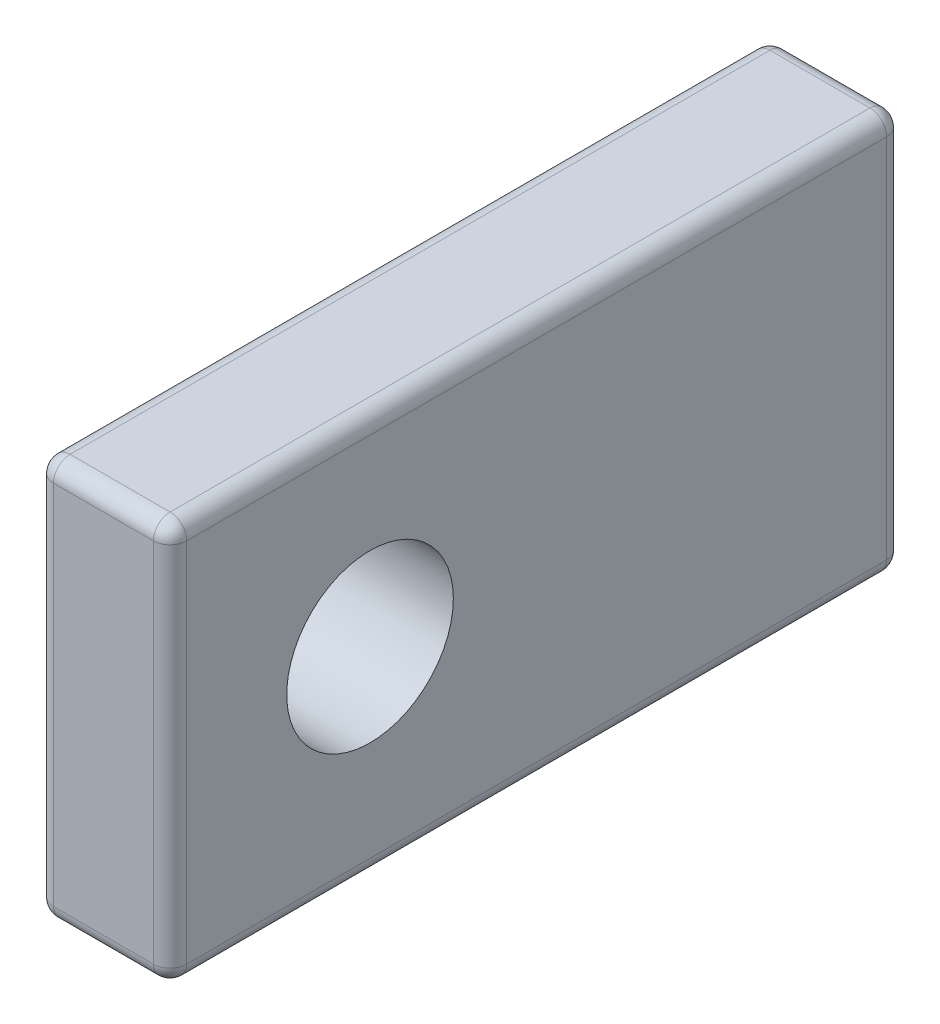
from build123d import *

# Parameters (mm, degrees)
SKETCH2_W           = 34.925
SKETCH2_H           = 19.05
SKETCH2_R           = 3.96875
BOSS_EXTRUDE1_DEPTH = 3.175
FILLET1_R           = 0.79375


with BuildPart() as part:
    # Sketch2 → Boss-Extrude1 (new, symmetric)
    with BuildSketch(Plane(origin=(0, 0, 0), x_dir=(0, 0, -1), z_dir=(1, 0, 0))):
        with Locations((7.9375, 0)):
            Rectangle(SKETCH2_W, SKETCH2_H)
        Circle(SKETCH2_R, mode=Mode.SUBTRACT)
    extrude(amount=BOSS_EXTRUDE1_DEPTH, both=True)

    # Fillet1
    fillet1_edges = [part.edges().sort_by_distance(p)[0] for p in [
        (3.175, 0, -25.4),
        (3.175, 9.525, -7.9375),
        (3.175, 0, 9.525),
        (-3.175, 9.525, -7.9375),
        (-3.175, 0, -25.4),
        (-3.175, -9.525, -7.9375),
        (-3.175, 0, 9.525),
        (3.175, -9.525, -7.9375),
        (0, 9.525, 9.525),
        (0, 9.525, -25.4),
        (0, -9.525, -25.4),
        (0, -9.525, 9.525),
    ]]
    fillet(fillet1_edges, radius=FILLET1_R)


solid = part.part
